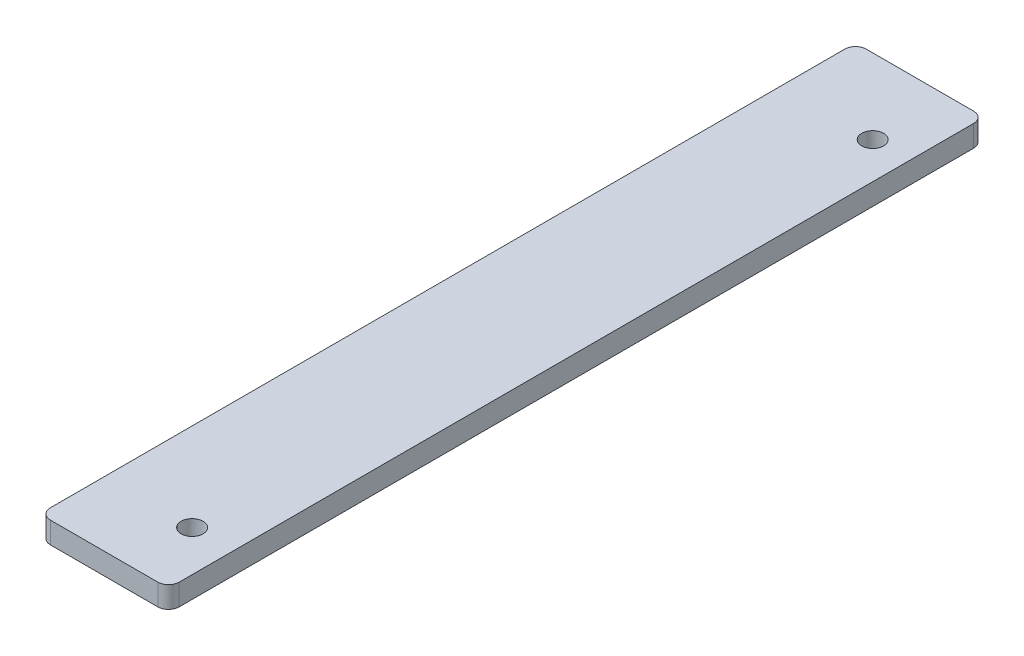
ISO-10303-21;
HEADER;
FILE_DESCRIPTION(('STEP AP214'),'2;1');
FILE_NAME('part.step','',(''),(''),'','','');
FILE_SCHEMA(('AUTOMOTIVE_DESIGN { 1 0 10303 214 1 1 1 1 }'));
ENDSEC;
DATA;
#1=APPLICATION_CONTEXT('core data for automotive mechanical design processes');
#2=APPLICATION_PROTOCOL_DEFINITION('international standard','automotive_design',2000,#1);
#3=PRODUCT_CONTEXT('',#1,'mechanical');
#4=PRODUCT('Part','Part','',(#3));
#5=PRODUCT_RELATED_PRODUCT_CATEGORY('part','',(#4));
#6=PRODUCT_DEFINITION_FORMATION('','',#4);
#7=PRODUCT_DEFINITION_CONTEXT('part definition',#1,'design');
#8=PRODUCT_DEFINITION('design','',#6,#7);
#9=PRODUCT_DEFINITION_SHAPE('','',#8);
#10=(LENGTH_UNIT() NAMED_UNIT(*) SI_UNIT(.MILLI.,.METRE.));
#11=(NAMED_UNIT(*) PLANE_ANGLE_UNIT() SI_UNIT($,.RADIAN.));
#12=(NAMED_UNIT(*) SI_UNIT($,.STERADIAN.) SOLID_ANGLE_UNIT());
#13=UNCERTAINTY_MEASURE_WITH_UNIT(LENGTH_MEASURE(1.E-05),#10,'distance_accuracy_value','');
#14=(GEOMETRIC_REPRESENTATION_CONTEXT(3) GLOBAL_UNCERTAINTY_ASSIGNED_CONTEXT((#13)) GLOBAL_UNIT_ASSIGNED_CONTEXT((#10,
#11,#12)) REPRESENTATION_CONTEXT('',''));
#15=CARTESIAN_POINT('',(0.,0.,0.));
#16=DIRECTION('',(0.,0.,1.));
#17=DIRECTION('',(1.,0.,0.));
#18=AXIS2_PLACEMENT_3D('',#15,#16,#17);
#19=CARTESIAN_POINT('',(-25.,-5.,185.));
#20=DIRECTION('',(0.,1.,0.));
#21=DIRECTION('',(0.,0.,1.));
#22=AXIS2_PLACEMENT_3D('',#19,#20,#21);
#23=CYLINDRICAL_SURFACE('',#22,5.);
#24=CARTESIAN_POINT('',(-25.,5.,185.));
#25=DIRECTION('',(0.,1.,0.));
#26=DIRECTION('',(0.,0.,1.));
#27=AXIS2_PLACEMENT_3D('',#24,#25,#26);
#28=CIRCLE('',#27,5.);
#29=CARTESIAN_POINT('',(-30.,5.,185.));
#30=VERTEX_POINT('',#29);
#31=CARTESIAN_POINT('',(-25.,5.,190.));
#32=VERTEX_POINT('',#31);
#33=EDGE_CURVE('E132',#30,#32,#28,.T.);
#34=ORIENTED_EDGE('',*,*,#33,.F.);
#35=DIRECTION('',(0.,1.,0.));
#36=VECTOR('',#35,1.);
#37=CARTESIAN_POINT('',(-30.,-5.,185.));
#38=LINE('',#37,#36);
#39=CARTESIAN_POINT('',(-30.,-5.,185.));
#40=VERTEX_POINT('',#39);
#41=EDGE_CURVE('E11',#40,#30,#38,.T.);
#42=ORIENTED_EDGE('',*,*,#41,.F.);
#43=CARTESIAN_POINT('',(-25.,-5.,185.));
#44=DIRECTION('',(0.,1.,0.));
#45=DIRECTION('',(0.,0.,1.));
#46=AXIS2_PLACEMENT_3D('',#43,#44,#45);
#47=CIRCLE('',#46,5.);
#48=CARTESIAN_POINT('',(-25.,-5.,190.));
#49=VERTEX_POINT('',#48);
#50=EDGE_CURVE('E153',#40,#49,#47,.T.);
#51=ORIENTED_EDGE('',*,*,#50,.T.);
#52=DIRECTION('',(0.,1.,0.));
#53=VECTOR('',#52,1.);
#54=CARTESIAN_POINT('',(-25.,-5.,190.));
#55=LINE('',#54,#53);
#56=EDGE_CURVE('E38',#49,#32,#55,.T.);
#57=ORIENTED_EDGE('',*,*,#56,.T.);
#58=EDGE_LOOP('',(#34,#42,#51,#57));
#59=FACE_BOUND('',#58,.T.);
#60=ADVANCED_FACE('F35',(#59),#23,.T.);
#61=CARTESIAN_POINT('',(-30.,-5.,-185.));
#62=DIRECTION('',(-1.,0.,0.));
#63=DIRECTION('',(0.,0.,1.));
#64=AXIS2_PLACEMENT_3D('',#61,#62,#63);
#65=PLANE('',#64);
#66=DIRECTION('',(0.,0.,1.));
#67=VECTOR('',#66,1.);
#68=CARTESIAN_POINT('',(-30.,5.,-185.));
#69=LINE('',#68,#67);
#70=CARTESIAN_POINT('',(-30.,5.,-185.));
#71=VERTEX_POINT('',#70);
#72=EDGE_CURVE('E151',#71,#30,#69,.T.);
#73=ORIENTED_EDGE('',*,*,#72,.F.);
#74=DIRECTION('',(0.,1.,0.));
#75=VECTOR('',#74,1.);
#76=CARTESIAN_POINT('',(-30.,-5.,-185.));
#77=LINE('',#76,#75);
#78=CARTESIAN_POINT('',(-30.,-5.,-185.));
#79=VERTEX_POINT('',#78);
#80=EDGE_CURVE('E44',#79,#71,#77,.T.);
#81=ORIENTED_EDGE('',*,*,#80,.F.);
#82=DIRECTION('',(0.,0.,1.));
#83=VECTOR('',#82,1.);
#84=CARTESIAN_POINT('',(-30.,-5.,-185.));
#85=LINE('',#84,#83);
#86=EDGE_CURVE('E122',#79,#40,#85,.T.);
#87=ORIENTED_EDGE('',*,*,#86,.T.);
#88=ORIENTED_EDGE('',*,*,#41,.T.);
#89=EDGE_LOOP('',(#73,#81,#87,#88));
#90=FACE_BOUND('',#89,.T.);
#91=ADVANCED_FACE('F165',(#90),#65,.T.);
#92=CARTESIAN_POINT('',(-25.,-5.,-185.));
#93=DIRECTION('',(0.,1.,0.));
#94=DIRECTION('',(0.,0.,1.));
#95=AXIS2_PLACEMENT_3D('',#92,#93,#94);
#96=CYLINDRICAL_SURFACE('',#95,5.);
#97=CARTESIAN_POINT('',(-25.,5.,-185.));
#98=DIRECTION('',(0.,1.,0.));
#99=DIRECTION('',(0.,0.,1.));
#100=AXIS2_PLACEMENT_3D('',#97,#98,#99);
#101=CIRCLE('',#100,5.);
#102=CARTESIAN_POINT('',(-25.,5.,-190.));
#103=VERTEX_POINT('',#102);
#104=EDGE_CURVE('E109',#103,#71,#101,.T.);
#105=ORIENTED_EDGE('',*,*,#104,.F.);
#106=DIRECTION('',(0.,1.,0.));
#107=VECTOR('',#106,1.);
#108=CARTESIAN_POINT('',(-25.,-5.,-190.));
#109=LINE('',#108,#107);
#110=CARTESIAN_POINT('',(-25.,-5.,-190.));
#111=VERTEX_POINT('',#110);
#112=EDGE_CURVE('E104',#111,#103,#109,.T.);
#113=ORIENTED_EDGE('',*,*,#112,.F.);
#114=CARTESIAN_POINT('',(-25.,-5.,-185.));
#115=DIRECTION('',(0.,1.,0.));
#116=DIRECTION('',(0.,0.,1.));
#117=AXIS2_PLACEMENT_3D('',#114,#115,#116);
#118=CIRCLE('',#117,5.);
#119=EDGE_CURVE('E107',#111,#79,#118,.T.);
#120=ORIENTED_EDGE('',*,*,#119,.T.);
#121=ORIENTED_EDGE('',*,*,#80,.T.);
#122=EDGE_LOOP('',(#105,#113,#120,#121));
#123=FACE_BOUND('',#122,.T.);
#124=ADVANCED_FACE('F106',(#123),#96,.T.);
#125=CARTESIAN_POINT('',(25.,-5.,-190.));
#126=DIRECTION('',(0.,0.,-1.));
#127=DIRECTION('',(-1.,0.,0.));
#128=AXIS2_PLACEMENT_3D('',#125,#126,#127);
#129=PLANE('',#128);
#130=DIRECTION('',(-1.,0.,0.));
#131=VECTOR('',#130,1.);
#132=CARTESIAN_POINT('',(25.,5.,-190.));
#133=LINE('',#132,#131);
#134=CARTESIAN_POINT('',(25.,5.,-190.));
#135=VERTEX_POINT('',#134);
#136=EDGE_CURVE('E148',#135,#103,#133,.T.);
#137=ORIENTED_EDGE('',*,*,#136,.F.);
#138=DIRECTION('',(0.,1.,0.));
#139=VECTOR('',#138,1.);
#140=CARTESIAN_POINT('',(25.,-5.,-190.));
#141=LINE('',#140,#139);
#142=CARTESIAN_POINT('',(25.,-5.,-190.));
#143=VERTEX_POINT('',#142);
#144=EDGE_CURVE('E114',#143,#135,#141,.T.);
#145=ORIENTED_EDGE('',*,*,#144,.F.);
#146=DIRECTION('',(-1.,0.,0.));
#147=VECTOR('',#146,1.);
#148=CARTESIAN_POINT('',(25.,-5.,-190.));
#149=LINE('',#148,#147);
#150=EDGE_CURVE('E120',#143,#111,#149,.T.);
#151=ORIENTED_EDGE('',*,*,#150,.T.);
#152=ORIENTED_EDGE('',*,*,#112,.T.);
#153=EDGE_LOOP('',(#137,#145,#151,#152));
#154=FACE_BOUND('',#153,.T.);
#155=ADVANCED_FACE('F124',(#154),#129,.T.);
#156=CARTESIAN_POINT('',(25.,-5.,-185.));
#157=DIRECTION('',(0.,1.,0.));
#158=DIRECTION('',(0.,0.,1.));
#159=AXIS2_PLACEMENT_3D('',#156,#157,#158);
#160=CYLINDRICAL_SURFACE('',#159,5.);
#161=CARTESIAN_POINT('',(25.,5.,-185.));
#162=DIRECTION('',(0.,1.,0.));
#163=DIRECTION('',(0.,0.,1.));
#164=AXIS2_PLACEMENT_3D('',#161,#162,#163);
#165=CIRCLE('',#164,5.);
#166=CARTESIAN_POINT('',(30.,5.,-185.));
#167=VERTEX_POINT('',#166);
#168=EDGE_CURVE('E145',#167,#135,#165,.T.);
#169=ORIENTED_EDGE('',*,*,#168,.F.);
#170=DIRECTION('',(0.,1.,0.));
#171=VECTOR('',#170,1.);
#172=CARTESIAN_POINT('',(30.,-5.,-185.));
#173=LINE('',#172,#171);
#174=CARTESIAN_POINT('',(30.,-5.,-185.));
#175=VERTEX_POINT('',#174);
#176=EDGE_CURVE('E157',#175,#167,#173,.T.);
#177=ORIENTED_EDGE('',*,*,#176,.F.);
#178=CARTESIAN_POINT('',(25.,-5.,-185.));
#179=DIRECTION('',(0.,1.,0.));
#180=DIRECTION('',(0.,0.,1.));
#181=AXIS2_PLACEMENT_3D('',#178,#179,#180);
#182=CIRCLE('',#181,5.);
#183=EDGE_CURVE('E125',#175,#143,#182,.T.);
#184=ORIENTED_EDGE('',*,*,#183,.T.);
#185=ORIENTED_EDGE('',*,*,#144,.T.);
#186=EDGE_LOOP('',(#169,#177,#184,#185));
#187=FACE_BOUND('',#186,.T.);
#188=ADVANCED_FACE('F178',(#187),#160,.T.);
#189=CARTESIAN_POINT('',(30.,-5.,185.));
#190=DIRECTION('',(1.,0.,0.));
#191=DIRECTION('',(0.,0.,-1.));
#192=AXIS2_PLACEMENT_3D('',#189,#190,#191);
#193=PLANE('',#192);
#194=DIRECTION('',(0.,0.,-1.));
#195=VECTOR('',#194,1.);
#196=CARTESIAN_POINT('',(30.,5.,185.));
#197=LINE('',#196,#195);
#198=CARTESIAN_POINT('',(30.,5.,185.));
#199=VERTEX_POINT('',#198);
#200=EDGE_CURVE('E142',#199,#167,#197,.T.);
#201=ORIENTED_EDGE('',*,*,#200,.F.);
#202=DIRECTION('',(0.,1.,0.));
#203=VECTOR('',#202,1.);
#204=CARTESIAN_POINT('',(30.,-5.,185.));
#205=LINE('',#204,#203);
#206=CARTESIAN_POINT('',(30.,-5.,185.));
#207=VERTEX_POINT('',#206);
#208=EDGE_CURVE('E159',#207,#199,#205,.T.);
#209=ORIENTED_EDGE('',*,*,#208,.F.);
#210=DIRECTION('',(0.,0.,-1.));
#211=VECTOR('',#210,1.);
#212=CARTESIAN_POINT('',(30.,-5.,185.));
#213=LINE('',#212,#211);
#214=EDGE_CURVE('E127',#207,#175,#213,.T.);
#215=ORIENTED_EDGE('',*,*,#214,.T.);
#216=ORIENTED_EDGE('',*,*,#176,.T.);
#217=EDGE_LOOP('',(#201,#209,#215,#216));
#218=FACE_BOUND('',#217,.T.);
#219=ADVANCED_FACE('F181',(#218),#193,.T.);
#220=CARTESIAN_POINT('',(25.,-5.,185.));
#221=DIRECTION('',(0.,1.,0.));
#222=DIRECTION('',(0.,0.,1.));
#223=AXIS2_PLACEMENT_3D('',#220,#221,#222);
#224=CYLINDRICAL_SURFACE('',#223,5.);
#225=CARTESIAN_POINT('',(25.,5.,185.));
#226=DIRECTION('',(0.,1.,0.));
#227=DIRECTION('',(0.,0.,1.));
#228=AXIS2_PLACEMENT_3D('',#225,#226,#227);
#229=CIRCLE('',#228,5.);
#230=CARTESIAN_POINT('',(25.,5.,190.));
#231=VERTEX_POINT('',#230);
#232=EDGE_CURVE('E139',#231,#199,#229,.T.);
#233=ORIENTED_EDGE('',*,*,#232,.F.);
#234=DIRECTION('',(0.,1.,0.));
#235=VECTOR('',#234,1.);
#236=CARTESIAN_POINT('',(25.,-5.,190.));
#237=LINE('',#236,#235);
#238=CARTESIAN_POINT('',(25.,-5.,190.));
#239=VERTEX_POINT('',#238);
#240=EDGE_CURVE('E160',#239,#231,#237,.T.);
#241=ORIENTED_EDGE('',*,*,#240,.F.);
#242=CARTESIAN_POINT('',(25.,-5.,185.));
#243=DIRECTION('',(0.,1.,0.));
#244=DIRECTION('',(0.,0.,1.));
#245=AXIS2_PLACEMENT_3D('',#242,#243,#244);
#246=CIRCLE('',#245,5.);
#247=EDGE_CURVE('E227',#239,#207,#246,.T.);
#248=ORIENTED_EDGE('',*,*,#247,.T.);
#249=ORIENTED_EDGE('',*,*,#208,.T.);
#250=EDGE_LOOP('',(#233,#241,#248,#249));
#251=FACE_BOUND('',#250,.T.);
#252=ADVANCED_FACE('F185',(#251),#224,.T.);
#253=CARTESIAN_POINT('',(-25.,-5.,190.));
#254=DIRECTION('',(0.,0.,1.));
#255=DIRECTION('',(1.,0.,0.));
#256=AXIS2_PLACEMENT_3D('',#253,#254,#255);
#257=PLANE('',#256);
#258=DIRECTION('',(1.,0.,0.));
#259=VECTOR('',#258,1.);
#260=CARTESIAN_POINT('',(-25.,5.,190.));
#261=LINE('',#260,#259);
#262=EDGE_CURVE('E135',#32,#231,#261,.T.);
#263=ORIENTED_EDGE('',*,*,#262,.F.);
#264=ORIENTED_EDGE('',*,*,#56,.F.);
#265=DIRECTION('',(1.,0.,0.));
#266=VECTOR('',#265,1.);
#267=CARTESIAN_POINT('',(-25.,-5.,190.));
#268=LINE('',#267,#266);
#269=EDGE_CURVE('E225',#49,#239,#268,.T.);
#270=ORIENTED_EDGE('',*,*,#269,.T.);
#271=ORIENTED_EDGE('',*,*,#240,.T.);
#272=EDGE_LOOP('',(#263,#264,#270,#271));
#273=FACE_BOUND('',#272,.T.);
#274=ADVANCED_FACE('F162',(#273),#257,.T.);
#275=CARTESIAN_POINT('',(-25.,-5.,185.));
#276=DIRECTION('',(0.,1.,0.));
#277=DIRECTION('',(0.,0.,1.));
#278=AXIS2_PLACEMENT_3D('',#275,#276,#277);
#279=PLANE('',#278);
#280=CARTESIAN_POINT('',(11.,-5.,160.));
#281=DIRECTION('',(0.,1.,0.));
#282=DIRECTION('',(0.,0.,-1.));
#283=AXIS2_PLACEMENT_3D('',#280,#281,#282);
#284=CIRCLE('',#283,5.09999999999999);
#285=CARTESIAN_POINT('',(11.,-5.,154.9));
#286=VERTEX_POINT('',#285);
#287=EDGE_CURVE('E212',#286,#286,#284,.T.);
#288=ORIENTED_EDGE('',*,*,#287,.T.);
#289=EDGE_LOOP('',(#288));
#290=FACE_BOUND('',#289,.T.);
#291=CARTESIAN_POINT('',(13.,-5.,-155.));
#292=DIRECTION('',(0.,1.,0.));
#293=DIRECTION('',(0.,0.,-1.));
#294=AXIS2_PLACEMENT_3D('',#291,#292,#293);
#295=CIRCLE('',#294,5.09999999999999);
#296=CARTESIAN_POINT('',(13.,-5.,-160.1));
#297=VERTEX_POINT('',#296);
#298=EDGE_CURVE('E136',#297,#297,#295,.T.);
#299=ORIENTED_EDGE('',*,*,#298,.T.);
#300=EDGE_LOOP('',(#299));
#301=FACE_BOUND('',#300,.T.);
#302=ORIENTED_EDGE('',*,*,#50,.F.);
#303=ORIENTED_EDGE('',*,*,#86,.F.);
#304=ORIENTED_EDGE('',*,*,#119,.F.);
#305=ORIENTED_EDGE('',*,*,#150,.F.);
#306=ORIENTED_EDGE('',*,*,#183,.F.);
#307=ORIENTED_EDGE('',*,*,#214,.F.);
#308=ORIENTED_EDGE('',*,*,#247,.F.);
#309=ORIENTED_EDGE('',*,*,#269,.F.);
#310=EDGE_LOOP('',(#302,#303,#304,#305,#306,#307,#308,#309));
#311=FACE_BOUND('',#310,.T.);
#312=ADVANCED_FACE('F118',(#290,#301,#311),#279,.F.);
#313=CARTESIAN_POINT('',(-25.,5.,185.));
#314=DIRECTION('',(0.,1.,0.));
#315=DIRECTION('',(0.,0.,1.));
#316=AXIS2_PLACEMENT_3D('',#313,#314,#315);
#317=PLANE('',#316);
#318=CARTESIAN_POINT('',(11.,5.,160.));
#319=DIRECTION('',(0.,1.,0.));
#320=DIRECTION('',(0.,0.,-1.));
#321=AXIS2_PLACEMENT_3D('',#318,#319,#320);
#322=CIRCLE('',#321,5.09999999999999);
#323=CARTESIAN_POINT('',(11.,5.,154.9));
#324=VERTEX_POINT('',#323);
#325=EDGE_CURVE('E215',#324,#324,#322,.T.);
#326=ORIENTED_EDGE('',*,*,#325,.F.);
#327=EDGE_LOOP('',(#326));
#328=FACE_BOUND('',#327,.T.);
#329=CARTESIAN_POINT('',(13.,5.,-155.));
#330=DIRECTION('',(0.,1.,0.));
#331=DIRECTION('',(0.,0.,-1.));
#332=AXIS2_PLACEMENT_3D('',#329,#330,#331);
#333=CIRCLE('',#332,5.09999999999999);
#334=CARTESIAN_POINT('',(13.,5.,-160.1));
#335=VERTEX_POINT('',#334);
#336=EDGE_CURVE('E217',#335,#335,#333,.T.);
#337=ORIENTED_EDGE('',*,*,#336,.F.);
#338=EDGE_LOOP('',(#337));
#339=FACE_BOUND('',#338,.T.);
#340=ORIENTED_EDGE('',*,*,#33,.T.);
#341=ORIENTED_EDGE('',*,*,#262,.T.);
#342=ORIENTED_EDGE('',*,*,#232,.T.);
#343=ORIENTED_EDGE('',*,*,#200,.T.);
#344=ORIENTED_EDGE('',*,*,#168,.T.);
#345=ORIENTED_EDGE('',*,*,#136,.T.);
#346=ORIENTED_EDGE('',*,*,#104,.T.);
#347=ORIENTED_EDGE('',*,*,#72,.T.);
#348=EDGE_LOOP('',(#340,#341,#342,#343,#344,#345,#346,#347));
#349=FACE_BOUND('',#348,.T.);
#350=ADVANCED_FACE('F164',(#328,#339,#349),#317,.T.);
#351=CARTESIAN_POINT('',(13.,-5.,-155.));
#352=DIRECTION('',(0.,1.,0.));
#353=DIRECTION('',(0.,0.,1.));
#354=AXIS2_PLACEMENT_3D('',#351,#352,#353);
#355=CYLINDRICAL_SURFACE('',#354,5.09999999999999);
#356=ORIENTED_EDGE('',*,*,#298,.F.);
#357=EDGE_LOOP('',(#356));
#358=FACE_BOUND('',#357,.T.);
#359=ORIENTED_EDGE('',*,*,#336,.T.);
#360=EDGE_LOOP('',(#359));
#361=FACE_BOUND('',#360,.T.);
#362=ADVANCED_FACE('F197',(#358,#361),#355,.F.);
#363=CARTESIAN_POINT('',(11.,-5.,160.));
#364=DIRECTION('',(0.,1.,0.));
#365=DIRECTION('',(0.,0.,1.));
#366=AXIS2_PLACEMENT_3D('',#363,#364,#365);
#367=CYLINDRICAL_SURFACE('',#366,5.09999999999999);
#368=ORIENTED_EDGE('',*,*,#287,.F.);
#369=EDGE_LOOP('',(#368));
#370=FACE_BOUND('',#369,.T.);
#371=ORIENTED_EDGE('',*,*,#325,.T.);
#372=EDGE_LOOP('',(#371));
#373=FACE_BOUND('',#372,.T.);
#374=ADVANCED_FACE('F204',(#370,#373),#367,.F.);
#375=CLOSED_SHELL('',(#60,#91,#124,#155,#188,#219,#252,#274,#312,#350,#362,#374));
#376=MANIFOLD_SOLID_BREP('B2',#375);
#377=ADVANCED_BREP_SHAPE_REPRESENTATION('',(#18,#376),#14);
#378=SHAPE_DEFINITION_REPRESENTATION(#9,#377);
ENDSEC;
END-ISO-10303-21;
